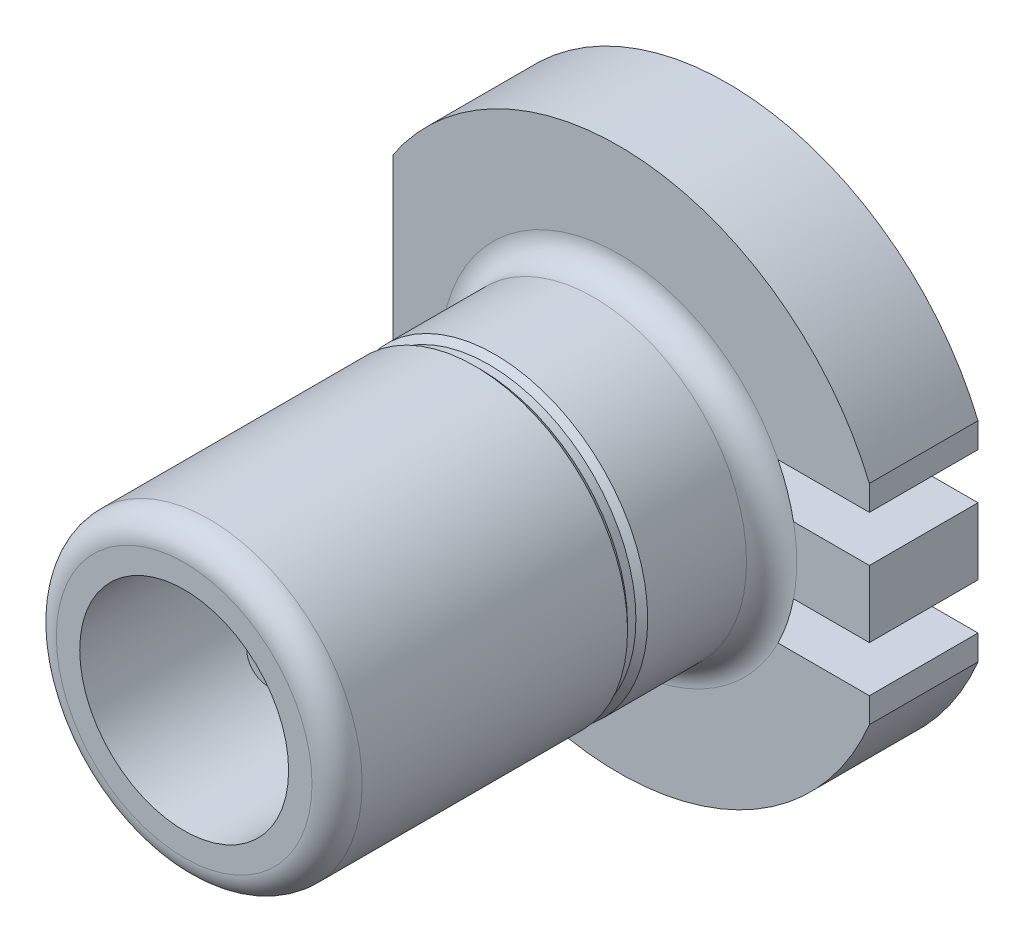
ISO-10303-21;
HEADER;
FILE_DESCRIPTION(('STEP AP214'),'2;1');
FILE_NAME('part.step','',(''),(''),'','','');
FILE_SCHEMA(('AUTOMOTIVE_DESIGN { 1 0 10303 214 1 1 1 1 }'));
ENDSEC;
DATA;
#1=APPLICATION_CONTEXT('core data for automotive mechanical design processes');
#2=APPLICATION_PROTOCOL_DEFINITION('international standard','automotive_design',2000,#1);
#3=PRODUCT_CONTEXT('',#1,'mechanical');
#4=PRODUCT('Part','Part','',(#3));
#5=PRODUCT_RELATED_PRODUCT_CATEGORY('part','',(#4));
#6=PRODUCT_DEFINITION_FORMATION('','',#4);
#7=PRODUCT_DEFINITION_CONTEXT('part definition',#1,'design');
#8=PRODUCT_DEFINITION('design','',#6,#7);
#9=PRODUCT_DEFINITION_SHAPE('','',#8);
#10=(LENGTH_UNIT() NAMED_UNIT(*) SI_UNIT(.MILLI.,.METRE.));
#11=(NAMED_UNIT(*) PLANE_ANGLE_UNIT() SI_UNIT($,.RADIAN.));
#12=(NAMED_UNIT(*) SI_UNIT($,.STERADIAN.) SOLID_ANGLE_UNIT());
#13=UNCERTAINTY_MEASURE_WITH_UNIT(LENGTH_MEASURE(1.E-05),#10,'distance_accuracy_value','');
#14=(GEOMETRIC_REPRESENTATION_CONTEXT(3) GLOBAL_UNCERTAINTY_ASSIGNED_CONTEXT((#13)) GLOBAL_UNIT_ASSIGNED_CONTEXT((#10,
#11,#12)) REPRESENTATION_CONTEXT('',''));
#15=CARTESIAN_POINT('',(0.,0.,0.));
#16=DIRECTION('',(0.,0.,1.));
#17=DIRECTION('',(1.,0.,0.));
#18=AXIS2_PLACEMENT_3D('',#15,#16,#17);
#19=CARTESIAN_POINT('',(0.,0.,1.3));
#20=DIRECTION('',(0.,0.,-1.));
#21=DIRECTION('',(-1.,0.,0.));
#22=AXIS2_PLACEMENT_3D('',#19,#20,#21);
#23=PLANE('',#22);
#24=CARTESIAN_POINT('',(0.,0.,1.3));
#25=DIRECTION('',(0.,0.,1.));
#26=DIRECTION('',(1.,0.,0.));
#27=AXIS2_PLACEMENT_3D('',#24,#25,#26);
#28=CIRCLE('',#27,2.13);
#29=CARTESIAN_POINT('',(1.9064102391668,-0.950000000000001,1.3));
#30=VERTEX_POINT('',#29);
#31=CARTESIAN_POINT('',(2.09210420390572,-0.4,1.3));
#32=VERTEX_POINT('',#31);
#33=EDGE_CURVE('E58',#30,#32,#28,.T.);
#34=ORIENTED_EDGE('',*,*,#33,.F.);
#35=DIRECTION('',(-1.,0.,0.));
#36=VECTOR('',#35,1.);
#37=CARTESIAN_POINT('',(0.447213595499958,-0.95,1.3));
#38=LINE('',#37,#36);
#39=CARTESIAN_POINT('',(0.447213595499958,-0.95,1.3));
#40=VERTEX_POINT('',#39);
#41=EDGE_CURVE('E145',#30,#40,#38,.T.);
#42=ORIENTED_EDGE('',*,*,#41,.T.);
#43=CARTESIAN_POINT('',(0.,0.,1.3));
#44=DIRECTION('',(0.,0.,-1.));
#45=DIRECTION('',(1.,0.,0.));
#46=AXIS2_PLACEMENT_3D('',#43,#44,#45);
#47=CIRCLE('',#46,1.05);
#48=CARTESIAN_POINT('',(0.447213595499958,0.95,1.3));
#49=VERTEX_POINT('',#48);
#50=EDGE_CURVE('E253',#40,#49,#47,.T.);
#51=ORIENTED_EDGE('',*,*,#50,.T.);
#52=DIRECTION('',(1.,0.,0.));
#53=VECTOR('',#52,1.);
#54=CARTESIAN_POINT('',(0.447213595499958,0.95,1.3));
#55=LINE('',#54,#53);
#56=CARTESIAN_POINT('',(1.9064102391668,0.95,1.3));
#57=VERTEX_POINT('',#56);
#58=EDGE_CURVE('E251',#49,#57,#55,.T.);
#59=ORIENTED_EDGE('',*,*,#58,.T.);
#60=CARTESIAN_POINT('',(2.09210420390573,0.400000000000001,1.3));
#61=VERTEX_POINT('',#60);
#62=EDGE_CURVE('E163',#61,#57,#28,.T.);
#63=ORIENTED_EDGE('',*,*,#62,.F.);
#64=DIRECTION('',(-1.,0.,0.));
#65=VECTOR('',#64,1.);
#66=CARTESIAN_POINT('',(3.,0.4,1.3));
#67=LINE('',#66,#65);
#68=CARTESIAN_POINT('',(1.3,0.4,1.3));
#69=VERTEX_POINT('',#68);
#70=EDGE_CURVE('E194',#61,#69,#67,.T.);
#71=ORIENTED_EDGE('',*,*,#70,.T.);
#72=DIRECTION('',(0.,-1.,0.));
#73=VECTOR('',#72,1.);
#74=CARTESIAN_POINT('',(1.3,0.4,1.3));
#75=LINE('',#74,#73);
#76=CARTESIAN_POINT('',(1.3,-0.4,1.3));
#77=VERTEX_POINT('',#76);
#78=EDGE_CURVE('E199',#69,#77,#75,.T.);
#79=ORIENTED_EDGE('',*,*,#78,.T.);
#80=DIRECTION('',(1.,0.,0.));
#81=VECTOR('',#80,1.);
#82=CARTESIAN_POINT('',(3.,-0.4,1.3));
#83=LINE('',#82,#81);
#84=EDGE_CURVE('E202',#77,#32,#83,.T.);
#85=ORIENTED_EDGE('',*,*,#84,.T.);
#86=EDGE_LOOP('',(#34,#42,#51,#59,#63,#71,#79,#85));
#87=FACE_BOUND('',#86,.T.);
#88=ADVANCED_FACE('F35',(#87),#23,.T.);
#89=CARTESIAN_POINT('',(3.,0.4,1.3));
#90=DIRECTION('',(-1.,0.,0.));
#91=DIRECTION('',(0.,0.,1.));
#92=AXIS2_PLACEMENT_3D('',#89,#90,#91);
#93=PLANE('',#92);
#94=DIRECTION('',(0.,1.,0.));
#95=VECTOR('',#94,1.);
#96=CARTESIAN_POINT('',(3.,0.4,0.));
#97=LINE('',#96,#95);
#98=CARTESIAN_POINT('',(3.,-0.4,0.));
#99=VERTEX_POINT('',#98);
#100=CARTESIAN_POINT('',(3.,0.4,0.));
#101=VERTEX_POINT('',#100);
#102=EDGE_CURVE('E190',#99,#101,#97,.T.);
#103=ORIENTED_EDGE('',*,*,#102,.T.);
#104=DIRECTION('',(0.,0.,-1.));
#105=VECTOR('',#104,1.);
#106=CARTESIAN_POINT('',(3.,0.4,1.3));
#107=LINE('',#106,#105);
#108=CARTESIAN_POINT('',(3.,0.4,1.3));
#109=VERTEX_POINT('',#108);
#110=EDGE_CURVE('E43',#109,#101,#107,.T.);
#111=ORIENTED_EDGE('',*,*,#110,.F.);
#112=DIRECTION('',(0.,1.,0.));
#113=VECTOR('',#112,1.);
#114=CARTESIAN_POINT('',(3.,0.4,1.3));
#115=LINE('',#114,#113);
#116=CARTESIAN_POINT('',(3.,-0.4,1.3));
#117=VERTEX_POINT('',#116);
#118=EDGE_CURVE('E191',#117,#109,#115,.T.);
#119=ORIENTED_EDGE('',*,*,#118,.F.);
#120=DIRECTION('',(0.,0.,-1.));
#121=VECTOR('',#120,1.);
#122=CARTESIAN_POINT('',(3.,-0.4,1.3));
#123=LINE('',#122,#121);
#124=EDGE_CURVE('E204',#117,#99,#123,.T.);
#125=ORIENTED_EDGE('',*,*,#124,.T.);
#126=EDGE_LOOP('',(#103,#111,#119,#125));
#127=FACE_BOUND('',#126,.T.);
#128=ADVANCED_FACE('F37',(#127),#93,.F.);
#129=CARTESIAN_POINT('',(3.,0.4,1.3));
#130=DIRECTION('',(0.,-1.,0.));
#131=DIRECTION('',(1.,0.,0.));
#132=AXIS2_PLACEMENT_3D('',#129,#130,#131);
#133=PLANE('',#132);
#134=DIRECTION('',(-1.,0.,0.));
#135=VECTOR('',#134,1.);
#136=CARTESIAN_POINT('',(3.,0.4,0.));
#137=LINE('',#136,#135);
#138=CARTESIAN_POINT('',(1.3,0.4,0.));
#139=VERTEX_POINT('',#138);
#140=EDGE_CURVE('E207',#101,#139,#137,.T.);
#141=ORIENTED_EDGE('',*,*,#140,.T.);
#142=DIRECTION('',(0.,0.,-1.));
#143=VECTOR('',#142,1.);
#144=CARTESIAN_POINT('',(1.3,0.4,1.3));
#145=LINE('',#144,#143);
#146=EDGE_CURVE('E217',#69,#139,#145,.T.);
#147=ORIENTED_EDGE('',*,*,#146,.F.);
#148=ORIENTED_EDGE('',*,*,#70,.F.);
#149=EDGE_CURVE('E196',#109,#61,#67,.T.);
#150=ORIENTED_EDGE('',*,*,#149,.F.);
#151=ORIENTED_EDGE('',*,*,#110,.T.);
#152=EDGE_LOOP('',(#141,#147,#148,#150,#151));
#153=FACE_BOUND('',#152,.T.);
#154=ADVANCED_FACE('F222',(#153),#133,.F.);
#155=CARTESIAN_POINT('',(1.3,0.4,1.3));
#156=DIRECTION('',(1.,0.,0.));
#157=DIRECTION('',(0.,0.,-1.));
#158=AXIS2_PLACEMENT_3D('',#155,#156,#157);
#159=PLANE('',#158);
#160=DIRECTION('',(0.,-1.,0.));
#161=VECTOR('',#160,1.);
#162=CARTESIAN_POINT('',(1.3,0.4,0.));
#163=LINE('',#162,#161);
#164=CARTESIAN_POINT('',(1.3,-0.4,0.));
#165=VERTEX_POINT('',#164);
#166=EDGE_CURVE('E209',#139,#165,#163,.T.);
#167=ORIENTED_EDGE('',*,*,#166,.T.);
#168=DIRECTION('',(0.,0.,-1.));
#169=VECTOR('',#168,1.);
#170=CARTESIAN_POINT('',(1.3,-0.4,1.3));
#171=LINE('',#170,#169);
#172=EDGE_CURVE('E214',#77,#165,#171,.T.);
#173=ORIENTED_EDGE('',*,*,#172,.F.);
#174=ORIENTED_EDGE('',*,*,#78,.F.);
#175=ORIENTED_EDGE('',*,*,#146,.T.);
#176=EDGE_LOOP('',(#167,#173,#174,#175));
#177=FACE_BOUND('',#176,.T.);
#178=ADVANCED_FACE('F235',(#177),#159,.F.);
#179=CARTESIAN_POINT('',(3.,-0.4,1.3));
#180=DIRECTION('',(0.,1.,0.));
#181=DIRECTION('',(-1.,0.,0.));
#182=AXIS2_PLACEMENT_3D('',#179,#180,#181);
#183=PLANE('',#182);
#184=DIRECTION('',(1.,0.,0.));
#185=VECTOR('',#184,1.);
#186=CARTESIAN_POINT('',(3.,-0.4,0.));
#187=LINE('',#186,#185);
#188=EDGE_CURVE('E195',#165,#99,#187,.T.);
#189=ORIENTED_EDGE('',*,*,#188,.T.);
#190=ORIENTED_EDGE('',*,*,#124,.F.);
#191=EDGE_CURVE('E201',#32,#117,#83,.T.);
#192=ORIENTED_EDGE('',*,*,#191,.F.);
#193=ORIENTED_EDGE('',*,*,#84,.F.);
#194=ORIENTED_EDGE('',*,*,#172,.T.);
#195=EDGE_LOOP('',(#189,#190,#192,#193,#194));
#196=FACE_BOUND('',#195,.T.);
#197=ADVANCED_FACE('F239',(#196),#183,.F.);
#198=CARTESIAN_POINT('',(0.,0.,1.3));
#199=DIRECTION('',(0.,0.,-1.));
#200=DIRECTION('',(-1.,0.,0.));
#201=AXIS2_PLACEMENT_3D('',#198,#199,#200);
#202=PLANE('',#201);
#203=ORIENTED_EDGE('',*,*,#149,.T.);
#204=CARTESIAN_POINT('',(0.,0.,1.3));
#205=DIRECTION('',(0.,0.,1.));
#206=DIRECTION('',(1.,0.,0.));
#207=AXIS2_PLACEMENT_3D('',#204,#205,#206);
#208=CIRCLE('',#207,2.13);
#209=EDGE_CURVE('E11',#61,#32,#208,.F.);
#210=ORIENTED_EDGE('',*,*,#209,.T.);
#211=ORIENTED_EDGE('',*,*,#191,.T.);
#212=ORIENTED_EDGE('',*,*,#118,.T.);
#213=EDGE_LOOP('',(#203,#210,#211,#212));
#214=FACE_BOUND('',#213,.T.);
#215=ADVANCED_FACE('F244',(#214),#202,.F.);
#216=CARTESIAN_POINT('',(0.,0.,0.));
#217=DIRECTION('',(0.,0.,-1.));
#218=DIRECTION('',(-1.,0.,0.));
#219=AXIS2_PLACEMENT_3D('',#216,#217,#218);
#220=PLANE('',#219);
#221=ORIENTED_EDGE('',*,*,#102,.F.);
#222=ORIENTED_EDGE('',*,*,#188,.F.);
#223=ORIENTED_EDGE('',*,*,#166,.F.);
#224=ORIENTED_EDGE('',*,*,#140,.F.);
#225=EDGE_LOOP('',(#221,#222,#223,#224));
#226=FACE_BOUND('',#225,.T.);
#227=ADVANCED_FACE('F231',(#226),#220,.T.);
#228=CARTESIAN_POINT('',(0.,0.,6.5));
#229=DIRECTION('',(0.,0.,1.));
#230=DIRECTION('',(1.,0.,0.));
#231=AXIS2_PLACEMENT_3D('',#228,#229,#230);
#232=PLANE('',#231);
#233=CARTESIAN_POINT('',(0.,0.,6.5));
#234=DIRECTION('',(0.,0.,1.));
#235=DIRECTION('',(1.,0.,0.));
#236=AXIS2_PLACEMENT_3D('',#233,#234,#235);
#237=CIRCLE('',#236,1.25);
#238=CARTESIAN_POINT('',(1.25,0.,6.5));
#239=VERTEX_POINT('',#238);
#240=EDGE_CURVE('E320',#239,#239,#237,.T.);
#241=ORIENTED_EDGE('',*,*,#240,.F.);
#242=EDGE_LOOP('',(#241));
#243=FACE_BOUND('',#242,.T.);
#244=CARTESIAN_POINT('',(0.,0.,6.5));
#245=DIRECTION('',(0.,0.,1.));
#246=DIRECTION('',(1.,0.,0.));
#247=AXIS2_PLACEMENT_3D('',#244,#245,#246);
#248=CIRCLE('',#247,1.53);
#249=CARTESIAN_POINT('',(1.53,0.,6.5));
#250=VERTEX_POINT('',#249);
#251=EDGE_CURVE('E187',#250,#250,#248,.T.);
#252=ORIENTED_EDGE('',*,*,#251,.T.);
#253=EDGE_LOOP('',(#252));
#254=FACE_BOUND('',#253,.T.);
#255=ADVANCED_FACE('F352',(#243,#254),#232,.T.);
#256=CARTESIAN_POINT('',(0.,0.,6.2));
#257=DIRECTION('',(0.,0.,1.));
#258=DIRECTION('',(1.,0.,0.));
#259=AXIS2_PLACEMENT_3D('',#256,#257,#258);
#260=TOROIDAL_SURFACE('',#259,1.53,0.3);
#261=CARTESIAN_POINT('',(0.,0.,6.2));
#262=DIRECTION('',(0.,0.,1.));
#263=DIRECTION('',(1.,0.,0.));
#264=AXIS2_PLACEMENT_3D('',#261,#262,#263);
#265=CIRCLE('',#264,1.83);
#266=CARTESIAN_POINT('',(1.83,0.,6.2));
#267=VERTEX_POINT('',#266);
#268=EDGE_CURVE('E184',#267,#267,#265,.T.);
#269=ORIENTED_EDGE('',*,*,#268,.T.);
#270=EDGE_LOOP('',(#269));
#271=FACE_BOUND('',#270,.T.);
#272=ORIENTED_EDGE('',*,*,#251,.F.);
#273=EDGE_LOOP('',(#272));
#274=FACE_BOUND('',#273,.T.);
#275=ADVANCED_FACE('F355',(#271,#274),#260,.T.);
#276=CARTESIAN_POINT('',(0.,0.,1.3));
#277=DIRECTION('',(0.,0.,1.));
#278=DIRECTION('',(1.,0.,0.));
#279=AXIS2_PLACEMENT_3D('',#276,#277,#278);
#280=CYLINDRICAL_SURFACE('',#279,1.83);
#281=CARTESIAN_POINT('',(0.,0.,3.02380161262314));
#282=DIRECTION('',(0.,0.,1.));
#283=DIRECTION('',(1.,0.,0.));
#284=AXIS2_PLACEMENT_3D('',#281,#282,#283);
#285=CIRCLE('',#284,1.83);
#286=CARTESIAN_POINT('',(1.83,0.,3.02380161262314));
#287=VERTEX_POINT('',#286);
#288=EDGE_CURVE('E181',#287,#287,#285,.T.);
#289=ORIENTED_EDGE('',*,*,#288,.T.);
#290=EDGE_LOOP('',(#289));
#291=FACE_BOUND('',#290,.T.);
#292=ORIENTED_EDGE('',*,*,#268,.F.);
#293=EDGE_LOOP('',(#292));
#294=FACE_BOUND('',#293,.T.);
#295=ADVANCED_FACE('F360',(#291,#294),#280,.T.);
#296=CARTESIAN_POINT('',(0.,0.,3.02380161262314));
#297=DIRECTION('',(0.,0.,1.));
#298=DIRECTION('',(1.,0.,0.));
#299=AXIS2_PLACEMENT_3D('',#296,#297,#298);
#300=CONICAL_SURFACE('',#299,1.83,0.785398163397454);
#301=CARTESIAN_POINT('',(0.,0.,2.95309093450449));
#302=DIRECTION('',(0.,0.,1.));
#303=DIRECTION('',(1.,0.,0.));
#304=AXIS2_PLACEMENT_3D('',#301,#302,#303);
#305=CIRCLE('',#304,1.75928932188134);
#306=CARTESIAN_POINT('',(1.75928932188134,0.,2.95309093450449));
#307=VERTEX_POINT('',#306);
#308=EDGE_CURVE('E178',#307,#307,#305,.T.);
#309=ORIENTED_EDGE('',*,*,#308,.T.);
#310=EDGE_LOOP('',(#309));
#311=FACE_BOUND('',#310,.T.);
#312=ORIENTED_EDGE('',*,*,#288,.F.);
#313=EDGE_LOOP('',(#312));
#314=FACE_BOUND('',#313,.T.);
#315=ADVANCED_FACE('F366',(#311,#314),#300,.T.);
#316=CARTESIAN_POINT('',(0.,0.,1.3));
#317=DIRECTION('',(0.,0.,1.));
#318=DIRECTION('',(1.,0.,0.));
#319=AXIS2_PLACEMENT_3D('',#316,#317,#318);
#320=CYLINDRICAL_SURFACE('',#319,1.75928932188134);
#321=CARTESIAN_POINT('',(0.,0.,2.85309093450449));
#322=DIRECTION('',(0.,0.,1.));
#323=DIRECTION('',(1.,0.,0.));
#324=AXIS2_PLACEMENT_3D('',#321,#322,#323);
#325=CIRCLE('',#324,1.75928932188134);
#326=CARTESIAN_POINT('',(1.75928932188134,0.,2.85309093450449));
#327=VERTEX_POINT('',#326);
#328=EDGE_CURVE('E175',#327,#327,#325,.T.);
#329=ORIENTED_EDGE('',*,*,#328,.T.);
#330=EDGE_LOOP('',(#329));
#331=FACE_BOUND('',#330,.T.);
#332=ORIENTED_EDGE('',*,*,#308,.F.);
#333=EDGE_LOOP('',(#332));
#334=FACE_BOUND('',#333,.T.);
#335=ADVANCED_FACE('F472',(#331,#334),#320,.T.);
#336=CARTESIAN_POINT('',(0.,0.,2.85309093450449));
#337=DIRECTION('',(0.,0.,-1.));
#338=DIRECTION('',(-1.,0.,0.));
#339=AXIS2_PLACEMENT_3D('',#336,#337,#338);
#340=CONICAL_SURFACE('',#339,1.75928932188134,0.785398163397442);
#341=CARTESIAN_POINT('',(0.,0.,2.78238025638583));
#342=DIRECTION('',(0.,0.,1.));
#343=DIRECTION('',(1.,0.,0.));
#344=AXIS2_PLACEMENT_3D('',#341,#342,#343);
#345=CIRCLE('',#344,1.83);
#346=CARTESIAN_POINT('',(1.83,0.,2.78238025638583));
#347=VERTEX_POINT('',#346);
#348=EDGE_CURVE('E172',#347,#347,#345,.T.);
#349=ORIENTED_EDGE('',*,*,#348,.T.);
#350=EDGE_LOOP('',(#349));
#351=FACE_BOUND('',#350,.T.);
#352=ORIENTED_EDGE('',*,*,#328,.F.);
#353=EDGE_LOOP('',(#352));
#354=FACE_BOUND('',#353,.T.);
#355=ADVANCED_FACE('F468',(#351,#354),#340,.T.);
#356=CARTESIAN_POINT('',(0.,0.,1.3));
#357=DIRECTION('',(0.,0.,1.));
#358=DIRECTION('',(1.,0.,0.));
#359=AXIS2_PLACEMENT_3D('',#356,#357,#358);
#360=CYLINDRICAL_SURFACE('',#359,1.83);
#361=CARTESIAN_POINT('',(0.,0.,1.6));
#362=DIRECTION('',(0.,0.,1.));
#363=DIRECTION('',(1.,0.,0.));
#364=AXIS2_PLACEMENT_3D('',#361,#362,#363);
#365=CIRCLE('',#364,1.83);
#366=CARTESIAN_POINT('',(1.83,0.,1.6));
#367=VERTEX_POINT('',#366);
#368=EDGE_CURVE('E169',#367,#367,#365,.T.);
#369=ORIENTED_EDGE('',*,*,#368,.T.);
#370=EDGE_LOOP('',(#369));
#371=FACE_BOUND('',#370,.T.);
#372=ORIENTED_EDGE('',*,*,#348,.F.);
#373=EDGE_LOOP('',(#372));
#374=FACE_BOUND('',#373,.T.);
#375=ADVANCED_FACE('F465',(#371,#374),#360,.T.);
#376=CARTESIAN_POINT('',(0.,0.,1.6));
#377=DIRECTION('',(0.,0.,1.));
#378=DIRECTION('',(1.,0.,0.));
#379=AXIS2_PLACEMENT_3D('',#376,#377,#378);
#380=TOROIDAL_SURFACE('',#379,2.13,0.3);
#381=ORIENTED_EDGE('',*,*,#62,.T.);
#382=EDGE_CURVE('E161',#57,#30,#28,.T.);
#383=ORIENTED_EDGE('',*,*,#382,.T.);
#384=ORIENTED_EDGE('',*,*,#33,.T.);
#385=ORIENTED_EDGE('',*,*,#209,.F.);
#386=EDGE_LOOP('',(#381,#383,#384,#385));
#387=FACE_BOUND('',#386,.T.);
#388=ORIENTED_EDGE('',*,*,#368,.F.);
#389=EDGE_LOOP('',(#388));
#390=FACE_BOUND('',#389,.T.);
#391=ADVANCED_FACE('F246',(#387,#390),#380,.F.);
#392=CARTESIAN_POINT('',(0.,0.,1.3));
#393=DIRECTION('',(0.,0.,-1.));
#394=DIRECTION('',(-1.,0.,0.));
#395=AXIS2_PLACEMENT_3D('',#392,#393,#394);
#396=CYLINDRICAL_SURFACE('',#395,3.25);
#397=CARTESIAN_POINT('',(0.,0.,0.));
#398=DIRECTION('',(0.,0.,1.));
#399=DIRECTION('',(1.,0.,0.));
#400=AXIS2_PLACEMENT_3D('',#397,#398,#399);
#401=CIRCLE('',#400,3.25);
#402=CARTESIAN_POINT('',(-2.7,-1.80900525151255,0.));
#403=VERTEX_POINT('',#402);
#404=CARTESIAN_POINT('',(3.,-1.25,0.));
#405=VERTEX_POINT('',#404);
#406=EDGE_CURVE('E159',#403,#405,#401,.T.);
#407=ORIENTED_EDGE('',*,*,#406,.T.);
#408=DIRECTION('',(0.,0.,-1.));
#409=VECTOR('',#408,1.);
#410=CARTESIAN_POINT('',(3.,-1.25,1.3));
#411=LINE('',#410,#409);
#412=CARTESIAN_POINT('',(3.,-1.25,1.3));
#413=VERTEX_POINT('',#412);
#414=EDGE_CURVE('E141',#413,#405,#411,.T.);
#415=ORIENTED_EDGE('',*,*,#414,.F.);
#416=CARTESIAN_POINT('',(0.,0.,1.3));
#417=DIRECTION('',(0.,0.,1.));
#418=DIRECTION('',(1.,0.,0.));
#419=AXIS2_PLACEMENT_3D('',#416,#417,#418);
#420=CIRCLE('',#419,3.25);
#421=CARTESIAN_POINT('',(-2.7,-1.80900525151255,1.3));
#422=VERTEX_POINT('',#421);
#423=EDGE_CURVE('E146',#422,#413,#420,.T.);
#424=ORIENTED_EDGE('',*,*,#423,.F.);
#425=DIRECTION('',(0.,0.,-1.));
#426=VECTOR('',#425,1.);
#427=CARTESIAN_POINT('',(-2.7,-1.80900525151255,1.3));
#428=LINE('',#427,#426);
#429=EDGE_CURVE('E267',#422,#403,#428,.T.);
#430=ORIENTED_EDGE('',*,*,#429,.T.);
#431=EDGE_LOOP('',(#407,#415,#424,#430));
#432=FACE_BOUND('',#431,.T.);
#433=ADVANCED_FACE('F157',(#432),#396,.T.);
#434=CARTESIAN_POINT('',(3.,-0.95,1.3));
#435=DIRECTION('',(-1.,0.,0.));
#436=DIRECTION('',(0.,0.,1.));
#437=AXIS2_PLACEMENT_3D('',#434,#435,#436);
#438=PLANE('',#437);
#439=DIRECTION('',(0.,1.,0.));
#440=VECTOR('',#439,1.);
#441=CARTESIAN_POINT('',(3.,-0.95,0.));
#442=LINE('',#441,#440);
#443=CARTESIAN_POINT('',(3.,-0.95,0.));
#444=VERTEX_POINT('',#443);
#445=EDGE_CURVE('E269',#405,#444,#442,.T.);
#446=ORIENTED_EDGE('',*,*,#445,.T.);
#447=DIRECTION('',(0.,0.,-1.));
#448=VECTOR('',#447,1.);
#449=CARTESIAN_POINT('',(3.,-0.95,1.3));
#450=LINE('',#449,#448);
#451=CARTESIAN_POINT('',(3.,-0.95,1.3));
#452=VERTEX_POINT('',#451);
#453=EDGE_CURVE('E144',#452,#444,#450,.T.);
#454=ORIENTED_EDGE('',*,*,#453,.F.);
#455=DIRECTION('',(0.,1.,0.));
#456=VECTOR('',#455,1.);
#457=CARTESIAN_POINT('',(3.,-0.95,1.3));
#458=LINE('',#457,#456);
#459=EDGE_CURVE('E137',#413,#452,#458,.T.);
#460=ORIENTED_EDGE('',*,*,#459,.F.);
#461=ORIENTED_EDGE('',*,*,#414,.T.);
#462=EDGE_LOOP('',(#446,#454,#460,#461));
#463=FACE_BOUND('',#462,.T.);
#464=ADVANCED_FACE('F139',(#463),#438,.F.);
#465=CARTESIAN_POINT('',(0.447213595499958,-0.95,1.3));
#466=DIRECTION('',(0.,-1.,0.));
#467=DIRECTION('',(1.,0.,0.));
#468=AXIS2_PLACEMENT_3D('',#465,#466,#467);
#469=PLANE('',#468);
#470=DIRECTION('',(-1.,0.,0.));
#471=VECTOR('',#470,1.);
#472=CARTESIAN_POINT('',(0.447213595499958,-0.95,0.));
#473=LINE('',#472,#471);
#474=CARTESIAN_POINT('',(0.447213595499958,-0.95,0.));
#475=VERTEX_POINT('',#474);
#476=EDGE_CURVE('E272',#444,#475,#473,.T.);
#477=ORIENTED_EDGE('',*,*,#476,.T.);
#478=DIRECTION('',(0.,0.,-1.));
#479=VECTOR('',#478,1.);
#480=CARTESIAN_POINT('',(0.447213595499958,-0.95,1.3));
#481=LINE('',#480,#479);
#482=EDGE_CURVE('E164',#40,#475,#481,.T.);
#483=ORIENTED_EDGE('',*,*,#482,.F.);
#484=ORIENTED_EDGE('',*,*,#41,.F.);
#485=EDGE_CURVE('E50',#452,#30,#38,.T.);
#486=ORIENTED_EDGE('',*,*,#485,.F.);
#487=ORIENTED_EDGE('',*,*,#453,.T.);
#488=EDGE_LOOP('',(#477,#483,#484,#486,#487));
#489=FACE_BOUND('',#488,.T.);
#490=ADVANCED_FACE('F318',(#489),#469,.F.);
#491=CARTESIAN_POINT('',(0.,0.,1.3));
#492=DIRECTION('',(0.,0.,-1.));
#493=DIRECTION('',(-1.,0.,0.));
#494=AXIS2_PLACEMENT_3D('',#491,#492,#493);
#495=CYLINDRICAL_SURFACE('',#494,1.05);
#496=CARTESIAN_POINT('',(0.,0.,0.));
#497=DIRECTION('',(0.,0.,-1.));
#498=DIRECTION('',(1.,0.,0.));
#499=AXIS2_PLACEMENT_3D('',#496,#497,#498);
#500=CIRCLE('',#499,1.05);
#501=CARTESIAN_POINT('',(0.447213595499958,0.95,0.));
#502=VERTEX_POINT('',#501);
#503=EDGE_CURVE('E274',#475,#502,#500,.T.);
#504=ORIENTED_EDGE('',*,*,#503,.T.);
#505=DIRECTION('',(0.,0.,-1.));
#506=VECTOR('',#505,1.);
#507=CARTESIAN_POINT('',(0.447213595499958,0.95,1.3));
#508=LINE('',#507,#506);
#509=EDGE_CURVE('E293',#49,#502,#508,.T.);
#510=ORIENTED_EDGE('',*,*,#509,.F.);
#511=ORIENTED_EDGE('',*,*,#50,.F.);
#512=ORIENTED_EDGE('',*,*,#482,.T.);
#513=EDGE_LOOP('',(#504,#510,#511,#512));
#514=FACE_BOUND('',#513,.T.);
#515=ADVANCED_FACE('F297',(#514),#495,.F.);
#516=CARTESIAN_POINT('',(0.447213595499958,0.95,1.3));
#517=DIRECTION('',(0.,1.,0.));
#518=DIRECTION('',(0.,0.,1.));
#519=AXIS2_PLACEMENT_3D('',#516,#517,#518);
#520=PLANE('',#519);
#521=DIRECTION('',(1.,0.,0.));
#522=VECTOR('',#521,1.);
#523=CARTESIAN_POINT('',(0.447213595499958,0.95,0.));
#524=LINE('',#523,#522);
#525=CARTESIAN_POINT('',(3.,0.95,0.));
#526=VERTEX_POINT('',#525);
#527=EDGE_CURVE('E276',#502,#526,#524,.T.);
#528=ORIENTED_EDGE('',*,*,#527,.T.);
#529=DIRECTION('',(0.,0.,-1.));
#530=VECTOR('',#529,1.);
#531=CARTESIAN_POINT('',(3.,0.95,1.3));
#532=LINE('',#531,#530);
#533=CARTESIAN_POINT('',(3.,0.95,1.3));
#534=VERTEX_POINT('',#533);
#535=EDGE_CURVE('E290',#534,#526,#532,.T.);
#536=ORIENTED_EDGE('',*,*,#535,.F.);
#537=EDGE_CURVE('E258',#57,#534,#55,.T.);
#538=ORIENTED_EDGE('',*,*,#537,.F.);
#539=ORIENTED_EDGE('',*,*,#58,.F.);
#540=ORIENTED_EDGE('',*,*,#509,.T.);
#541=EDGE_LOOP('',(#528,#536,#538,#539,#540));
#542=FACE_BOUND('',#541,.T.);
#543=ADVANCED_FACE('F306',(#542),#520,.F.);
#544=CARTESIAN_POINT('',(3.,1.25,1.3));
#545=DIRECTION('',(-1.,0.,0.));
#546=DIRECTION('',(0.,0.,1.));
#547=AXIS2_PLACEMENT_3D('',#544,#545,#546);
#548=PLANE('',#547);
#549=DIRECTION('',(0.,1.,0.));
#550=VECTOR('',#549,1.);
#551=CARTESIAN_POINT('',(3.,1.25,0.));
#552=LINE('',#551,#550);
#553=CARTESIAN_POINT('',(3.,1.25,0.));
#554=VERTEX_POINT('',#553);
#555=EDGE_CURVE('E278',#526,#554,#552,.T.);
#556=ORIENTED_EDGE('',*,*,#555,.T.);
#557=DIRECTION('',(0.,0.,-1.));
#558=VECTOR('',#557,1.);
#559=CARTESIAN_POINT('',(3.,1.25,1.3));
#560=LINE('',#559,#558);
#561=CARTESIAN_POINT('',(3.,1.25,1.3));
#562=VERTEX_POINT('',#561);
#563=EDGE_CURVE('E287',#562,#554,#560,.T.);
#564=ORIENTED_EDGE('',*,*,#563,.F.);
#565=DIRECTION('',(0.,1.,0.));
#566=VECTOR('',#565,1.);
#567=CARTESIAN_POINT('',(3.,1.25,1.3));
#568=LINE('',#567,#566);
#569=EDGE_CURVE('E257',#534,#562,#568,.T.);
#570=ORIENTED_EDGE('',*,*,#569,.F.);
#571=ORIENTED_EDGE('',*,*,#535,.T.);
#572=EDGE_LOOP('',(#556,#564,#570,#571));
#573=FACE_BOUND('',#572,.T.);
#574=ADVANCED_FACE('F309',(#573),#548,.F.);
#575=CARTESIAN_POINT('',(0.,0.,1.3));
#576=DIRECTION('',(0.,0.,-1.));
#577=DIRECTION('',(-1.,0.,0.));
#578=AXIS2_PLACEMENT_3D('',#575,#576,#577);
#579=CYLINDRICAL_SURFACE('',#578,3.25);
#580=CARTESIAN_POINT('',(0.,0.,0.));
#581=DIRECTION('',(0.,0.,1.));
#582=DIRECTION('',(1.,0.,0.));
#583=AXIS2_PLACEMENT_3D('',#580,#581,#582);
#584=CIRCLE('',#583,3.25);
#585=CARTESIAN_POINT('',(-2.7,1.80900525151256,0.));
#586=VERTEX_POINT('',#585);
#587=EDGE_CURVE('E280',#554,#586,#584,.T.);
#588=ORIENTED_EDGE('',*,*,#587,.T.);
#589=DIRECTION('',(0.,0.,-1.));
#590=VECTOR('',#589,1.);
#591=CARTESIAN_POINT('',(-2.7,1.80900525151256,1.3));
#592=LINE('',#591,#590);
#593=CARTESIAN_POINT('',(-2.7,1.80900525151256,1.3));
#594=VERTEX_POINT('',#593);
#595=EDGE_CURVE('E284',#594,#586,#592,.T.);
#596=ORIENTED_EDGE('',*,*,#595,.F.);
#597=CARTESIAN_POINT('',(0.,0.,1.3));
#598=DIRECTION('',(0.,0.,1.));
#599=DIRECTION('',(1.,0.,0.));
#600=AXIS2_PLACEMENT_3D('',#597,#598,#599);
#601=CIRCLE('',#600,3.25);
#602=EDGE_CURVE('E260',#562,#594,#601,.T.);
#603=ORIENTED_EDGE('',*,*,#602,.F.);
#604=ORIENTED_EDGE('',*,*,#563,.T.);
#605=EDGE_LOOP('',(#588,#596,#603,#604));
#606=FACE_BOUND('',#605,.T.);
#607=ADVANCED_FACE('F314',(#606),#579,.T.);
#608=CARTESIAN_POINT('',(-2.7,1.80900525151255,1.3));
#609=DIRECTION('',(1.,0.,0.));
#610=DIRECTION('',(0.,0.,-1.));
#611=AXIS2_PLACEMENT_3D('',#608,#609,#610);
#612=PLANE('',#611);
#613=DIRECTION('',(0.,-1.,0.));
#614=VECTOR('',#613,1.);
#615=CARTESIAN_POINT('',(-2.7,1.80900525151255,0.));
#616=LINE('',#615,#614);
#617=EDGE_CURVE('E155',#586,#403,#616,.T.);
#618=ORIENTED_EDGE('',*,*,#617,.T.);
#619=ORIENTED_EDGE('',*,*,#429,.F.);
#620=DIRECTION('',(0.,-1.,0.));
#621=VECTOR('',#620,1.);
#622=CARTESIAN_POINT('',(-2.7,1.80900525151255,1.3));
#623=LINE('',#622,#621);
#624=EDGE_CURVE('E151',#594,#422,#623,.T.);
#625=ORIENTED_EDGE('',*,*,#624,.F.);
#626=ORIENTED_EDGE('',*,*,#595,.T.);
#627=EDGE_LOOP('',(#618,#619,#625,#626));
#628=FACE_BOUND('',#627,.T.);
#629=ADVANCED_FACE('F317',(#628),#612,.F.);
#630=CARTESIAN_POINT('',(0.,0.,1.3));
#631=DIRECTION('',(0.,0.,1.));
#632=DIRECTION('',(1.,0.,0.));
#633=AXIS2_PLACEMENT_3D('',#630,#631,#632);
#634=PLANE('',#633);
#635=ORIENTED_EDGE('',*,*,#382,.F.);
#636=ORIENTED_EDGE('',*,*,#537,.T.);
#637=ORIENTED_EDGE('',*,*,#569,.T.);
#638=ORIENTED_EDGE('',*,*,#602,.T.);
#639=ORIENTED_EDGE('',*,*,#624,.T.);
#640=ORIENTED_EDGE('',*,*,#423,.T.);
#641=ORIENTED_EDGE('',*,*,#459,.T.);
#642=ORIENTED_EDGE('',*,*,#485,.T.);
#643=EDGE_LOOP('',(#635,#636,#637,#638,#639,#640,#641,#642));
#644=FACE_BOUND('',#643,.T.);
#645=ADVANCED_FACE('F149',(#644),#634,.T.);
#646=CARTESIAN_POINT('',(0.,0.,0.));
#647=DIRECTION('',(0.,0.,1.));
#648=DIRECTION('',(1.,0.,0.));
#649=AXIS2_PLACEMENT_3D('',#646,#647,#648);
#650=PLANE('',#649);
#651=ORIENTED_EDGE('',*,*,#406,.F.);
#652=ORIENTED_EDGE('',*,*,#617,.F.);
#653=ORIENTED_EDGE('',*,*,#587,.F.);
#654=ORIENTED_EDGE('',*,*,#555,.F.);
#655=ORIENTED_EDGE('',*,*,#527,.F.);
#656=ORIENTED_EDGE('',*,*,#503,.F.);
#657=ORIENTED_EDGE('',*,*,#476,.F.);
#658=ORIENTED_EDGE('',*,*,#445,.F.);
#659=EDGE_LOOP('',(#651,#652,#653,#654,#655,#656,#657,#658));
#660=FACE_BOUND('',#659,.T.);
#661=ADVANCED_FACE('F302',(#660),#650,.F.);
#662=CARTESIAN_POINT('',(0.,0.,1.5));
#663=DIRECTION('',(0.,0.,1.));
#664=DIRECTION('',(1.,0.,0.));
#665=AXIS2_PLACEMENT_3D('',#662,#663,#664);
#666=CYLINDRICAL_SURFACE('',#665,1.25);
#667=CARTESIAN_POINT('',(0.,0.,1.5));
#668=DIRECTION('',(0.,0.,1.));
#669=DIRECTION('',(1.,0.,0.));
#670=AXIS2_PLACEMENT_3D('',#667,#668,#669);
#671=CIRCLE('',#670,1.25);
#672=CARTESIAN_POINT('',(1.25,0.,1.5));
#673=VERTEX_POINT('',#672);
#674=EDGE_CURVE('E270',#673,#673,#671,.T.);
#675=ORIENTED_EDGE('',*,*,#674,.F.);
#676=EDGE_LOOP('',(#675));
#677=FACE_BOUND('',#676,.T.);
#678=ORIENTED_EDGE('',*,*,#240,.T.);
#679=EDGE_LOOP('',(#678));
#680=FACE_BOUND('',#679,.T.);
#681=ADVANCED_FACE('F343',(#677,#680),#666,.F.);
#682=CARTESIAN_POINT('',(0.,0.,1.5));
#683=DIRECTION('',(0.,0.,1.));
#684=DIRECTION('',(1.,0.,0.));
#685=AXIS2_PLACEMENT_3D('',#682,#683,#684);
#686=PLANE('',#685);
#687=CARTESIAN_POINT('',(0.,0.,1.5));
#688=DIRECTION('',(0.,0.,1.));
#689=DIRECTION('',(1.,0.,0.));
#690=AXIS2_PLACEMENT_3D('',#687,#688,#689);
#691=CIRCLE('',#690,0.25);
#692=CARTESIAN_POINT('',(0.25,0.,1.5));
#693=VERTEX_POINT('',#692);
#694=EDGE_CURVE('E326',#693,#693,#691,.T.);
#695=ORIENTED_EDGE('',*,*,#694,.F.);
#696=EDGE_LOOP('',(#695));
#697=FACE_BOUND('',#696,.T.);
#698=ORIENTED_EDGE('',*,*,#674,.T.);
#699=EDGE_LOOP('',(#698));
#700=FACE_BOUND('',#699,.T.);
#701=ADVANCED_FACE('F337',(#697,#700),#686,.T.);
#702=CARTESIAN_POINT('',(0.,0.,5.5));
#703=DIRECTION('',(0.,0.,-1.));
#704=DIRECTION('',(-1.,0.,0.));
#705=AXIS2_PLACEMENT_3D('',#702,#703,#704);
#706=CYLINDRICAL_SURFACE('',#705,0.25);
#707=CARTESIAN_POINT('',(0.,0.,5.5));
#708=DIRECTION('',(0.,0.,1.));
#709=DIRECTION('',(1.,0.,0.));
#710=AXIS2_PLACEMENT_3D('',#707,#708,#709);
#711=CIRCLE('',#710,0.25);
#712=CARTESIAN_POINT('',(0.25,0.,5.5));
#713=VERTEX_POINT('',#712);
#714=EDGE_CURVE('E323',#713,#713,#711,.T.);
#715=ORIENTED_EDGE('',*,*,#714,.F.);
#716=EDGE_LOOP('',(#715));
#717=FACE_BOUND('',#716,.T.);
#718=ORIENTED_EDGE('',*,*,#694,.T.);
#719=EDGE_LOOP('',(#718));
#720=FACE_BOUND('',#719,.T.);
#721=ADVANCED_FACE('F334',(#717,#720),#706,.T.);
#722=CARTESIAN_POINT('',(0.,0.,5.5));
#723=DIRECTION('',(0.,0.,1.));
#724=DIRECTION('',(1.,0.,0.));
#725=AXIS2_PLACEMENT_3D('',#722,#723,#724);
#726=PLANE('',#725);
#727=ORIENTED_EDGE('',*,*,#714,.T.);
#728=EDGE_LOOP('',(#727));
#729=FACE_BOUND('',#728,.T.);
#730=ADVANCED_FACE('F332',(#729),#726,.T.);
#731=CLOSED_SHELL('',(#88,#128,#154,#178,#197,#215,#227,#255,#275,#295,#315,#335,#355,#375,#391,
#433,#464,#490,#515,#543,#574,#607,#629,#645,#661,#681,#701,#721,#730));
#732=MANIFOLD_SOLID_BREP('B2',#731);
#733=ADVANCED_BREP_SHAPE_REPRESENTATION('',(#18,#732),#14);
#734=SHAPE_DEFINITION_REPRESENTATION(#9,#733);
ENDSEC;
END-ISO-10303-21;
